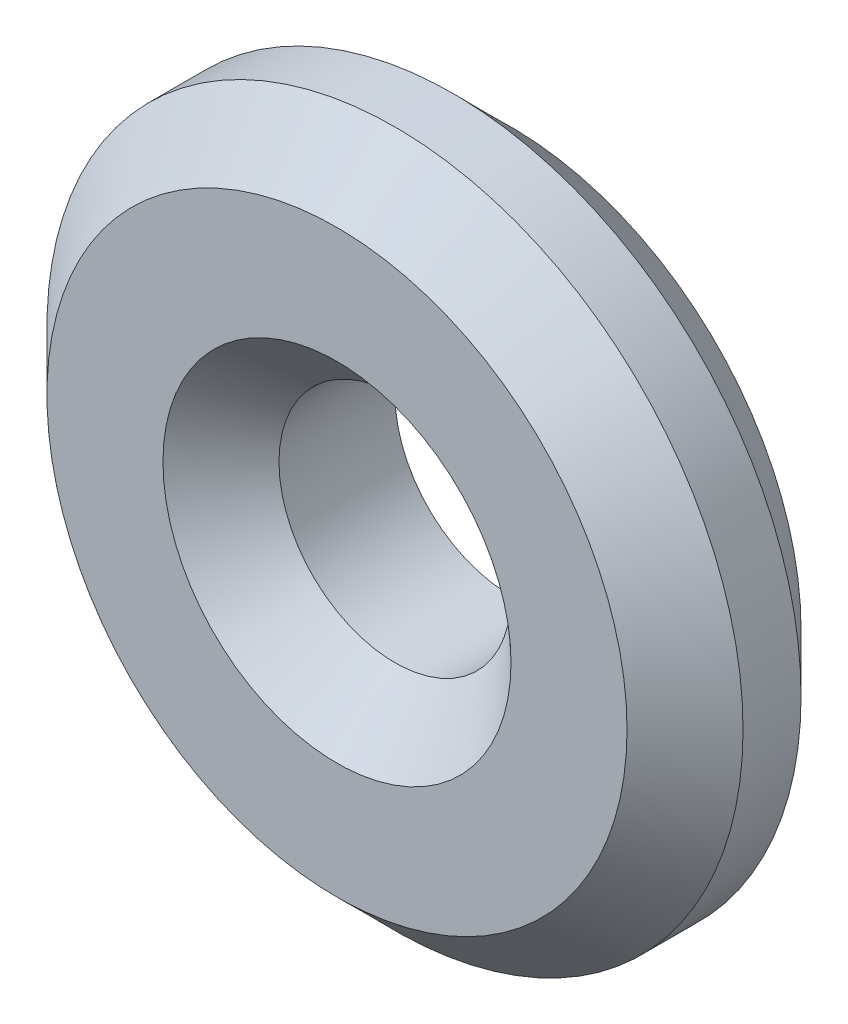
from build123d import *

# Parameters (mm, degrees)
ESQUISSE1_R             = 6
BASE_EXTRUSION_DEPTH    = 3
CHANFREIN1_SIZE         = 1
ESQUISSE2_R             = 2
ENL_V_MAT_EXTRU_1_DEPTH = 10
CHANFREIN3_SIZE         = 1


with BuildPart() as part:
    # Esquisse1 → Base-Extrusion (new body)
    with BuildSketch(Plane.XY):
        Circle(ESQUISSE1_R)
    extrude(amount=-BASE_EXTRUSION_DEPTH)

    # Chanfrein1
    chanfrein1_edges = [part.edges().sort_by_distance(p)[0] for p in [
        (-6, 0, 0),
        (-6, 0, -3),
    ]]
    chamfer(chanfrein1_edges, length=CHANFREIN1_SIZE)

    # Esquisse2 → Enl_v. mat.-Extru.1 (cut, through all)
    with BuildSketch(Plane.XY):
        Circle(ESQUISSE2_R)
    extrude(amount=-ENL_V_MAT_EXTRU_1_DEPTH, mode=Mode.SUBTRACT)

    # Chanfrein3
    chanfrein3_edges = [part.edges().sort_by_distance(p)[0] for p in [
        (-2, 0, 0),
    ]]
    chamfer(chanfrein3_edges, length=CHANFREIN3_SIZE)


solid = part.part
